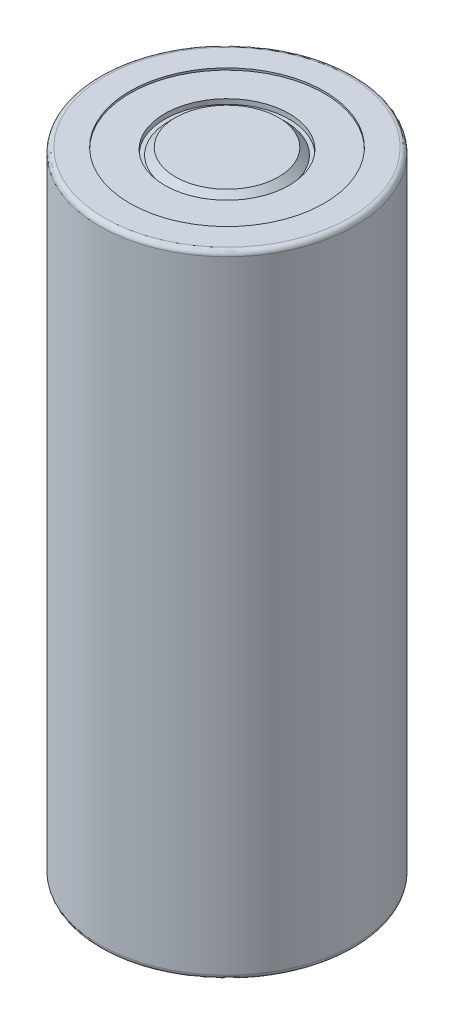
ISO-10303-21;
HEADER;
FILE_DESCRIPTION(('STEP AP214'),'2;1');
FILE_NAME('part.step','',(''),(''),'','','');
FILE_SCHEMA(('AUTOMOTIVE_DESIGN { 1 0 10303 214 1 1 1 1 }'));
ENDSEC;
DATA;
#1=APPLICATION_CONTEXT('core data for automotive mechanical design processes');
#2=APPLICATION_PROTOCOL_DEFINITION('international standard','automotive_design',2000,#1);
#3=PRODUCT_CONTEXT('',#1,'mechanical');
#4=PRODUCT('Part','Part','',(#3));
#5=PRODUCT_RELATED_PRODUCT_CATEGORY('part','',(#4));
#6=PRODUCT_DEFINITION_FORMATION('','',#4);
#7=PRODUCT_DEFINITION_CONTEXT('part definition',#1,'design');
#8=PRODUCT_DEFINITION('design','',#6,#7);
#9=PRODUCT_DEFINITION_SHAPE('','',#8);
#10=(LENGTH_UNIT() NAMED_UNIT(*) SI_UNIT(.MILLI.,.METRE.));
#11=(NAMED_UNIT(*) PLANE_ANGLE_UNIT() SI_UNIT($,.RADIAN.));
#12=(NAMED_UNIT(*) SI_UNIT($,.STERADIAN.) SOLID_ANGLE_UNIT());
#13=UNCERTAINTY_MEASURE_WITH_UNIT(LENGTH_MEASURE(1.E-05),#10,'distance_accuracy_value','');
#14=(GEOMETRIC_REPRESENTATION_CONTEXT(3) GLOBAL_UNCERTAINTY_ASSIGNED_CONTEXT((#13)) GLOBAL_UNIT_ASSIGNED_CONTEXT((#10,
#11,#12)) REPRESENTATION_CONTEXT('',''));
#15=CARTESIAN_POINT('',(0.,0.,0.));
#16=DIRECTION('',(0.,0.,1.));
#17=DIRECTION('',(1.,0.,0.));
#18=AXIS2_PLACEMENT_3D('',#15,#16,#17);
#19=CARTESIAN_POINT('',(0.,65.,0.));
#20=DIRECTION('',(0.,-1.,0.));
#21=DIRECTION('',(0.,0.,-1.));
#22=AXIS2_PLACEMENT_3D('',#19,#20,#21);
#23=CYLINDRICAL_SURFACE('',#22,13.1);
#24=CARTESIAN_POINT('',(0.,64.5,0.));
#25=DIRECTION('',(0.,1.,0.));
#26=DIRECTION('',(0.,0.,1.));
#27=AXIS2_PLACEMENT_3D('',#24,#25,#26);
#28=CIRCLE('',#27,13.1);
#29=CARTESIAN_POINT('',(0.,64.5,13.1));
#30=VERTEX_POINT('',#29);
#31=EDGE_CURVE('E45',#30,#30,#28,.F.);
#32=ORIENTED_EDGE('',*,*,#31,.T.);
#33=EDGE_LOOP('',(#32));
#34=FACE_BOUND('',#33,.T.);
#35=CARTESIAN_POINT('',(0.,0.5,0.));
#36=DIRECTION('',(0.,1.,0.));
#37=DIRECTION('',(0.,0.,1.));
#38=AXIS2_PLACEMENT_3D('',#35,#36,#37);
#39=CIRCLE('',#38,13.1);
#40=CARTESIAN_POINT('',(0.,0.5,13.1));
#41=VERTEX_POINT('',#40);
#42=EDGE_CURVE('E49',#41,#41,#39,.T.);
#43=ORIENTED_EDGE('',*,*,#42,.T.);
#44=EDGE_LOOP('',(#43));
#45=FACE_BOUND('',#44,.T.);
#46=ADVANCED_FACE('F38',(#34,#45),#23,.T.);
#47=CARTESIAN_POINT('',(0.,65.,0.));
#48=DIRECTION('',(0.,1.,0.));
#49=DIRECTION('',(0.,0.,1.));
#50=AXIS2_PLACEMENT_3D('',#47,#48,#49);
#51=PLANE('',#50);
#52=CARTESIAN_POINT('',(0.,65.,0.));
#53=DIRECTION('',(0.,1.,0.));
#54=DIRECTION('',(0.,0.,1.));
#55=AXIS2_PLACEMENT_3D('',#52,#53,#54);
#56=CIRCLE('',#55,12.6);
#57=CARTESIAN_POINT('',(0.,65.,12.6));
#58=VERTEX_POINT('',#57);
#59=EDGE_CURVE('E53',#58,#58,#56,.T.);
#60=ORIENTED_EDGE('',*,*,#59,.T.);
#61=EDGE_LOOP('',(#60));
#62=FACE_BOUND('',#61,.T.);
#63=CARTESIAN_POINT('',(0.,65.,0.));
#64=DIRECTION('',(0.,1.,0.));
#65=DIRECTION('',(0.,0.,1.));
#66=AXIS2_PLACEMENT_3D('',#63,#64,#65);
#67=CIRCLE('',#66,10.);
#68=CARTESIAN_POINT('',(0.,65.,10.));
#69=VERTEX_POINT('',#68);
#70=EDGE_CURVE('E65',#69,#69,#67,.T.);
#71=ORIENTED_EDGE('',*,*,#70,.F.);
#72=EDGE_LOOP('',(#71));
#73=FACE_BOUND('',#72,.T.);
#74=ADVANCED_FACE('F106',(#62,#73),#51,.T.);
#75=CARTESIAN_POINT('',(0.,0.,0.));
#76=DIRECTION('',(0.,1.,0.));
#77=DIRECTION('',(0.,0.,1.));
#78=AXIS2_PLACEMENT_3D('',#75,#76,#77);
#79=PLANE('',#78);
#80=CARTESIAN_POINT('',(0.,0.,0.));
#81=DIRECTION('',(0.,1.,0.));
#82=DIRECTION('',(0.,0.,1.));
#83=AXIS2_PLACEMENT_3D('',#80,#81,#82);
#84=CIRCLE('',#83,12.6);
#85=CARTESIAN_POINT('',(0.,0.,12.6));
#86=VERTEX_POINT('',#85);
#87=EDGE_CURVE('E10',#86,#86,#84,.F.);
#88=ORIENTED_EDGE('',*,*,#87,.T.);
#89=EDGE_LOOP('',(#88));
#90=FACE_BOUND('',#89,.T.);
#91=CARTESIAN_POINT('',(0.,0.,0.));
#92=DIRECTION('',(0.,-1.,0.));
#93=DIRECTION('',(0.,0.,-1.));
#94=AXIS2_PLACEMENT_3D('',#91,#92,#93);
#95=CIRCLE('',#94,10.);
#96=CARTESIAN_POINT('',(0.,0.,-10.));
#97=VERTEX_POINT('',#96);
#98=EDGE_CURVE('E67',#97,#97,#95,.T.);
#99=ORIENTED_EDGE('',*,*,#98,.F.);
#100=EDGE_LOOP('',(#99));
#101=FACE_BOUND('',#100,.T.);
#102=ADVANCED_FACE('F111',(#90,#101),#79,.F.);
#103=CARTESIAN_POINT('',(0.,0.2,0.));
#104=DIRECTION('',(0.,-1.,0.));
#105=DIRECTION('',(0.,0.,-1.));
#106=AXIS2_PLACEMENT_3D('',#103,#104,#105);
#107=CYLINDRICAL_SURFACE('',#106,10.);
#108=CARTESIAN_POINT('',(0.,0.2,0.));
#109=DIRECTION('',(0.,-1.,0.));
#110=DIRECTION('',(0.,0.,-1.));
#111=AXIS2_PLACEMENT_3D('',#108,#109,#110);
#112=CIRCLE('',#111,10.);
#113=CARTESIAN_POINT('',(0.,0.2,-10.));
#114=VERTEX_POINT('',#113);
#115=EDGE_CURVE('E61',#114,#114,#112,.T.);
#116=ORIENTED_EDGE('',*,*,#115,.F.);
#117=EDGE_LOOP('',(#116));
#118=FACE_BOUND('',#117,.T.);
#119=ORIENTED_EDGE('',*,*,#98,.T.);
#120=EDGE_LOOP('',(#119));
#121=FACE_BOUND('',#120,.T.);
#122=ADVANCED_FACE('F140',(#118,#121),#107,.F.);
#123=CARTESIAN_POINT('',(0.,0.2,0.));
#124=DIRECTION('',(0.,-1.,0.));
#125=DIRECTION('',(0.,0.,-1.));
#126=AXIS2_PLACEMENT_3D('',#123,#124,#125);
#127=PLANE('',#126);
#128=ORIENTED_EDGE('',*,*,#115,.T.);
#129=EDGE_LOOP('',(#128));
#130=FACE_BOUND('',#129,.T.);
#131=ADVANCED_FACE('F134',(#130),#127,.T.);
#132=CARTESIAN_POINT('',(0.,64.8,0.));
#133=DIRECTION('',(0.,1.,0.));
#134=DIRECTION('',(0.,0.,1.));
#135=AXIS2_PLACEMENT_3D('',#132,#133,#134);
#136=CYLINDRICAL_SURFACE('',#135,10.);
#137=CARTESIAN_POINT('',(0.,64.8,0.));
#138=DIRECTION('',(0.,1.,0.));
#139=DIRECTION('',(0.,0.,1.));
#140=AXIS2_PLACEMENT_3D('',#137,#138,#139);
#141=CIRCLE('',#140,10.);
#142=CARTESIAN_POINT('',(0.,64.8,10.));
#143=VERTEX_POINT('',#142);
#144=EDGE_CURVE('E70',#143,#143,#141,.T.);
#145=ORIENTED_EDGE('',*,*,#144,.F.);
#146=EDGE_LOOP('',(#145));
#147=FACE_BOUND('',#146,.T.);
#148=ORIENTED_EDGE('',*,*,#70,.T.);
#149=EDGE_LOOP('',(#148));
#150=FACE_BOUND('',#149,.T.);
#151=ADVANCED_FACE('F101',(#147,#150),#136,.F.);
#152=CARTESIAN_POINT('',(0.,64.8,0.));
#153=DIRECTION('',(0.,1.,0.));
#154=DIRECTION('',(0.,0.,1.));
#155=AXIS2_PLACEMENT_3D('',#152,#153,#154);
#156=PLANE('',#155);
#157=CARTESIAN_POINT('',(0.,64.8,0.));
#158=DIRECTION('',(0.,1.,0.));
#159=DIRECTION('',(0.,0.,1.));
#160=AXIS2_PLACEMENT_3D('',#157,#158,#159);
#161=CIRCLE('',#160,6.4);
#162=CARTESIAN_POINT('',(0.,64.8,6.4));
#163=VERTEX_POINT('',#162);
#164=EDGE_CURVE('E62',#163,#163,#161,.T.);
#165=ORIENTED_EDGE('',*,*,#164,.F.);
#166=EDGE_LOOP('',(#165));
#167=FACE_BOUND('',#166,.T.);
#168=ORIENTED_EDGE('',*,*,#144,.T.);
#169=EDGE_LOOP('',(#168));
#170=FACE_BOUND('',#169,.T.);
#171=ADVANCED_FACE('F95',(#167,#170),#156,.T.);
#172=CARTESIAN_POINT('',(0.,64.3,0.));
#173=DIRECTION('',(0.,1.,0.));
#174=DIRECTION('',(0.,0.,1.));
#175=AXIS2_PLACEMENT_3D('',#172,#173,#174);
#176=CYLINDRICAL_SURFACE('',#175,6.4);
#177=ORIENTED_EDGE('',*,*,#164,.T.);
#178=EDGE_LOOP('',(#177));
#179=FACE_BOUND('',#178,.T.);
#180=CARTESIAN_POINT('',(0.,64.3,0.));
#181=DIRECTION('',(0.,1.,0.));
#182=DIRECTION('',(0.,0.,1.));
#183=AXIS2_PLACEMENT_3D('',#180,#181,#182);
#184=CIRCLE('',#183,6.4);
#185=CARTESIAN_POINT('',(0.,64.3,6.4));
#186=VERTEX_POINT('',#185);
#187=EDGE_CURVE('E66',#186,#186,#184,.T.);
#188=ORIENTED_EDGE('',*,*,#187,.F.);
#189=EDGE_LOOP('',(#188));
#190=FACE_BOUND('',#189,.T.);
#191=ADVANCED_FACE('F90',(#179,#190),#176,.F.);
#192=CARTESIAN_POINT('',(0.,64.3,0.));
#193=DIRECTION('',(0.,1.,0.));
#194=DIRECTION('',(0.,0.,1.));
#195=AXIS2_PLACEMENT_3D('',#192,#193,#194);
#196=PLANE('',#195);
#197=CARTESIAN_POINT('',(0.,64.3,0.));
#198=DIRECTION('',(0.,1.,0.));
#199=DIRECTION('',(0.,0.,1.));
#200=AXIS2_PLACEMENT_3D('',#197,#198,#199);
#201=CIRCLE('',#200,6.);
#202=CARTESIAN_POINT('',(0.,64.3,6.));
#203=VERTEX_POINT('',#202);
#204=EDGE_CURVE('E79',#203,#203,#201,.T.);
#205=ORIENTED_EDGE('',*,*,#204,.F.);
#206=EDGE_LOOP('',(#205));
#207=FACE_BOUND('',#206,.T.);
#208=ORIENTED_EDGE('',*,*,#187,.T.);
#209=EDGE_LOOP('',(#208));
#210=FACE_BOUND('',#209,.T.);
#211=ADVANCED_FACE('F86',(#207,#210),#196,.T.);
#212=CARTESIAN_POINT('',(0.,65.,0.));
#213=DIRECTION('',(0.,1.,0.));
#214=DIRECTION('',(0.,0.,1.));
#215=AXIS2_PLACEMENT_3D('',#212,#213,#214);
#216=PLANE('',#215);
#217=CARTESIAN_POINT('',(0.,65.,0.));
#218=DIRECTION('',(0.,1.,0.));
#219=DIRECTION('',(0.,0.,1.));
#220=AXIS2_PLACEMENT_3D('',#217,#218,#219);
#221=CIRCLE('',#220,5.29999999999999);
#222=CARTESIAN_POINT('',(0.,65.,5.29999999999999));
#223=VERTEX_POINT('',#222);
#224=EDGE_CURVE('E58',#223,#223,#221,.T.);
#225=ORIENTED_EDGE('',*,*,#224,.T.);
#226=EDGE_LOOP('',(#225));
#227=FACE_BOUND('',#226,.T.);
#228=ADVANCED_FACE('F89',(#227),#216,.T.);
#229=CARTESIAN_POINT('',(0.,65.,0.));
#230=DIRECTION('',(0.,-1.,0.));
#231=DIRECTION('',(0.,0.,-1.));
#232=AXIS2_PLACEMENT_3D('',#229,#230,#231);
#233=CONICAL_SURFACE('',#232,5.29999999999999,0.785398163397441);
#234=ORIENTED_EDGE('',*,*,#204,.T.);
#235=EDGE_LOOP('',(#234));
#236=FACE_BOUND('',#235,.T.);
#237=ORIENTED_EDGE('',*,*,#224,.F.);
#238=EDGE_LOOP('',(#237));
#239=FACE_BOUND('',#238,.T.);
#240=ADVANCED_FACE('F83',(#236,#239),#233,.T.);
#241=CARTESIAN_POINT('',(0.,64.5,0.));
#242=DIRECTION('',(0.,1.,0.));
#243=DIRECTION('',(0.,0.,1.));
#244=AXIS2_PLACEMENT_3D('',#241,#242,#243);
#245=TOROIDAL_SURFACE('',#244,12.6,0.5);
#246=ORIENTED_EDGE('',*,*,#31,.F.);
#247=EDGE_LOOP('',(#246));
#248=FACE_BOUND('',#247,.T.);
#249=ORIENTED_EDGE('',*,*,#59,.F.);
#250=EDGE_LOOP('',(#249));
#251=FACE_BOUND('',#250,.T.);
#252=ADVANCED_FACE('F121',(#248,#251),#245,.T.);
#253=CARTESIAN_POINT('',(0.,0.5,0.));
#254=DIRECTION('',(0.,1.,0.));
#255=DIRECTION('',(0.,0.,1.));
#256=AXIS2_PLACEMENT_3D('',#253,#254,#255);
#257=TOROIDAL_SURFACE('',#256,12.6,0.5);
#258=ORIENTED_EDGE('',*,*,#87,.F.);
#259=EDGE_LOOP('',(#258));
#260=FACE_BOUND('',#259,.T.);
#261=ORIENTED_EDGE('',*,*,#42,.F.);
#262=EDGE_LOOP('',(#261));
#263=FACE_BOUND('',#262,.T.);
#264=ADVANCED_FACE('F40',(#260,#263),#257,.T.);
#265=CLOSED_SHELL('',(#46,#74,#102,#122,#131,#151,#171,#191,#211,#228,#240,#252,#264));
#266=MANIFOLD_SOLID_BREP('B2',#265);
#267=ADVANCED_BREP_SHAPE_REPRESENTATION('',(#18,#266),#14);
#268=SHAPE_DEFINITION_REPRESENTATION(#9,#267);
ENDSEC;
END-ISO-10303-21;
